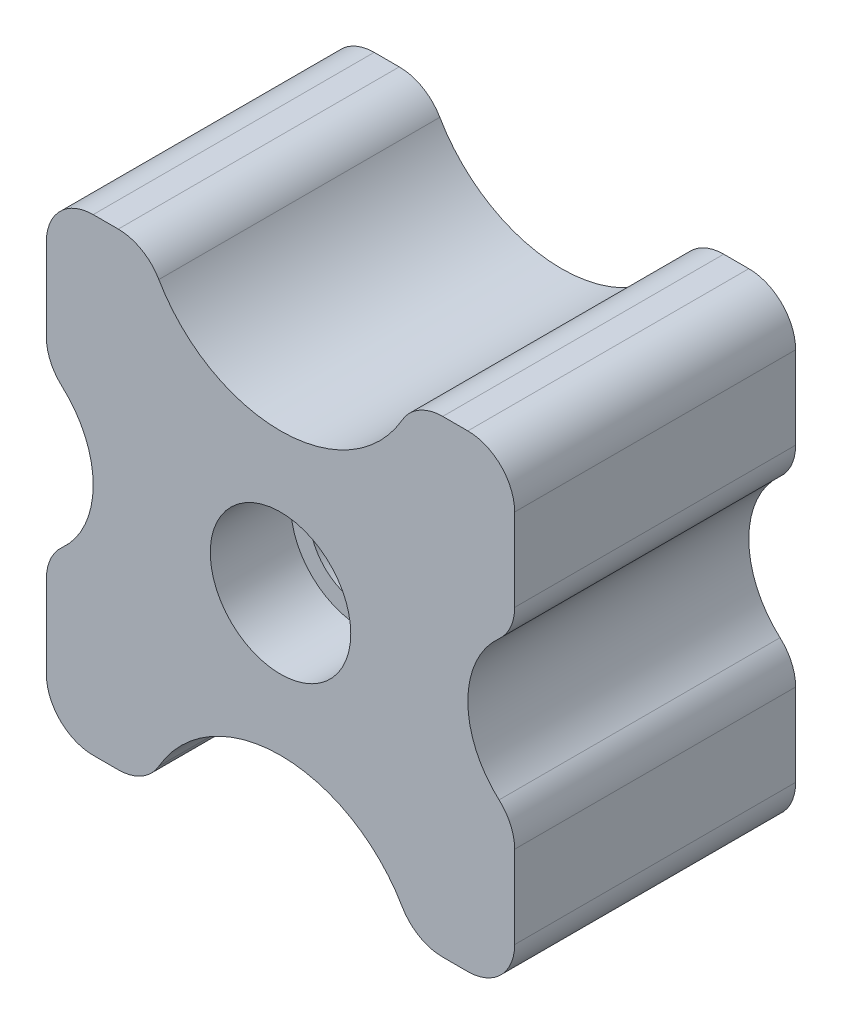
from build123d import *

# Parameters (mm, degrees)
SKIZZE1_W                                            = 50
SKIZZE1_H                                            = 50
AUFSATZ_LINEAR_AUSTRAGEN1_DEPTH                      = 30
SKIZZE2_R                                            = 10
SKIZZE2_R_2                                          = 15
SCHNITT_LINEAR_AUSTRAGEN2_DEPTH                      = 30
VERRUNDUNG1_R                                        = 5
STIRNSENKUNG_F_R_M8_ZYLINDERSCHRAUBE_MIT_D           = 11
STIRNSENKUNG_F_R_M8_ZYLINDERSCHRAUBE_MIT_CBORE_D     = 15
STIRNSENKUNG_F_R_M8_ZYLINDERSCHRAUBE_MIT_CBORE_DEPTH = 8.6


with BuildPart() as part:
    # Skizze1 → Aufsatz-Linear austragen1 (new body)
    with BuildSketch(Plane.XY):
        Rectangle(SKIZZE1_W, SKIZZE1_H)
    extrude(amount=AUFSATZ_LINEAR_AUSTRAGEN1_DEPTH)

    # Skizze2 → Schnitt-Linear austragen2 (cut)
    with BuildSketch(Plane.XY):
        with Locations((-30, 0)):
            Circle(SKIZZE2_R)
        with Locations((0, -30)):
            Circle(SKIZZE2_R_2)
        with Locations((30, 0)):
            Circle(SKIZZE2_R)
        with Locations((0, 30)):
            Circle(SKIZZE2_R_2)
    extrude(amount=SCHNITT_LINEAR_AUSTRAGEN2_DEPTH, mode=Mode.SUBTRACT)

    # Verrundung1
    verrundung1_edges = [part.edges().sort_by_distance(p)[0] for p in [
        (-25, -8.660254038, 15),
        (-25, 8.660254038, 15),
        (14.142135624, -25, 15),
        (-14.142135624, -25, 15),
        (25, 8.660254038, 15),
        (25, -8.660254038, 15),
        (-14.142135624, 25, 15),
        (14.142135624, 25, 15),
        (25, -25, 15),
        (-25, -25, 15),
        (-25, 25, 15),
        (25, 25, 15),
    ]]
    fillet(verrundung1_edges, radius=VERRUNDUNG1_R)

    # Stirnsenkung f_r M8 Zylinderschraube mit (through all)
    with Locations(Plane.XY.offset(30)):
        with Locations((0, 0)):
            CounterBoreHole(STIRNSENKUNG_F_R_M8_ZYLINDERSCHRAUBE_MIT_D / 2, STIRNSENKUNG_F_R_M8_ZYLINDERSCHRAUBE_MIT_CBORE_D / 2, STIRNSENKUNG_F_R_M8_ZYLINDERSCHRAUBE_MIT_CBORE_DEPTH)


solid = part.part
